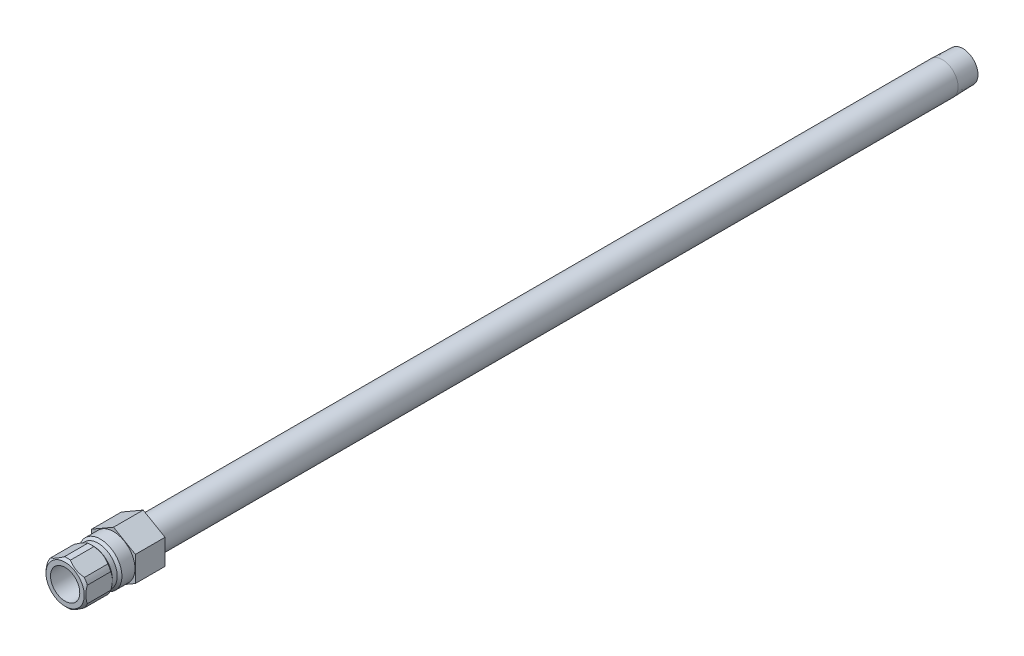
ISO-10303-21;
HEADER;
FILE_DESCRIPTION(('STEP AP214'),'2;1');
FILE_NAME('part.step','',(''),(''),'','','');
FILE_SCHEMA(('AUTOMOTIVE_DESIGN { 1 0 10303 214 1 1 1 1 }'));
ENDSEC;
DATA;
#1=APPLICATION_CONTEXT('core data for automotive mechanical design processes');
#2=APPLICATION_PROTOCOL_DEFINITION('international standard','automotive_design',2000,#1);
#3=PRODUCT_CONTEXT('',#1,'mechanical');
#4=PRODUCT('Part','Part','',(#3));
#5=PRODUCT_RELATED_PRODUCT_CATEGORY('part','',(#4));
#6=PRODUCT_DEFINITION_FORMATION('','',#4);
#7=PRODUCT_DEFINITION_CONTEXT('part definition',#1,'design');
#8=PRODUCT_DEFINITION('design','',#6,#7);
#9=PRODUCT_DEFINITION_SHAPE('','',#8);
#10=(LENGTH_UNIT() NAMED_UNIT(*) SI_UNIT(.MILLI.,.METRE.));
#11=(NAMED_UNIT(*) PLANE_ANGLE_UNIT() SI_UNIT($,.RADIAN.));
#12=(NAMED_UNIT(*) SI_UNIT($,.STERADIAN.) SOLID_ANGLE_UNIT());
#13=UNCERTAINTY_MEASURE_WITH_UNIT(LENGTH_MEASURE(1.E-05),#10,'distance_accuracy_value','');
#14=(GEOMETRIC_REPRESENTATION_CONTEXT(3) GLOBAL_UNCERTAINTY_ASSIGNED_CONTEXT((#13)) GLOBAL_UNIT_ASSIGNED_CONTEXT((#10,
#11,#12)) REPRESENTATION_CONTEXT('',''));
#15=CARTESIAN_POINT('',(0.,0.,0.));
#16=DIRECTION('',(0.,0.,1.));
#17=DIRECTION('',(1.,0.,0.));
#18=AXIS2_PLACEMENT_3D('',#15,#16,#17);
#19=CARTESIAN_POINT('',(0.,0.,-9.652));
#20=DIRECTION('',(0.,0.,-1.));
#21=DIRECTION('',(0.,1.,0.));
#22=AXIS2_PLACEMENT_3D('',#19,#20,#21);
#23=CYLINDRICAL_SURFACE('',#22,6.985);
#24=DIRECTION('',(0.,0.,-1.));
#25=VECTOR('',#24,1.);
#26=CARTESIAN_POINT('',(6.477,2.61509005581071,-9.652));
#27=LINE('',#26,#25);
#28=CARTESIAN_POINT('',(6.477,2.61509005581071,7.366));
#29=VERTEX_POINT('',#28);
#30=CARTESIAN_POINT('',(6.477,2.61509005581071,14.986));
#31=VERTEX_POINT('',#30);
#32=EDGE_CURVE('E372',#29,#31,#27,.F.);
#33=ORIENTED_EDGE('',*,*,#32,.F.);
#34=CARTESIAN_POINT('',(0.,0.,7.366));
#35=DIRECTION('',(0.,0.,-1.));
#36=DIRECTION('',(0.,1.,0.));
#37=AXIS2_PLACEMENT_3D('',#34,#35,#36);
#38=CIRCLE('',#37,6.985);
#39=CARTESIAN_POINT('',(5.50323442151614,4.30170151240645,7.366));
#40=VERTEX_POINT('',#39);
#41=EDGE_CURVE('E190',#40,#29,#38,.T.);
#42=ORIENTED_EDGE('',*,*,#41,.F.);
#43=DIRECTION('',(0.,0.,-1.));
#44=VECTOR('',#43,1.);
#45=CARTESIAN_POINT('',(5.50323442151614,4.30170151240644,-9.652));
#46=LINE('',#45,#44);
#47=CARTESIAN_POINT('',(5.50323442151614,4.30170151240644,14.986));
#48=VERTEX_POINT('',#47);
#49=EDGE_CURVE('E363',#48,#40,#46,.T.);
#50=ORIENTED_EDGE('',*,*,#49,.F.);
#51=CARTESIAN_POINT('',(0.,0.,14.986));
#52=DIRECTION('',(0.,0.,-1.));
#53=DIRECTION('',(0.,1.,0.));
#54=AXIS2_PLACEMENT_3D('',#51,#52,#53);
#55=CIRCLE('',#54,6.985);
#56=EDGE_CURVE('E205',#48,#31,#55,.T.);
#57=ORIENTED_EDGE('',*,*,#56,.T.);
#58=EDGE_LOOP('',(#33,#42,#50,#57));
#59=FACE_BOUND('',#58,.T.);
#60=ADVANCED_FACE('F34',(#59),#23,.T.);
#61=DIRECTION('',(0.,0.,-1.));
#62=VECTOR('',#61,1.);
#63=CARTESIAN_POINT('',(0.97376557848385,6.91679156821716,-9.652));
#64=LINE('',#63,#62);
#65=CARTESIAN_POINT('',(0.973765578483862,6.91679156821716,7.366));
#66=VERTEX_POINT('',#65);
#67=CARTESIAN_POINT('',(0.97376557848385,6.91679156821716,14.986));
#68=VERTEX_POINT('',#67);
#69=EDGE_CURVE('E283',#66,#68,#64,.F.);
#70=ORIENTED_EDGE('',*,*,#69,.F.);
#71=CARTESIAN_POINT('',(-0.973765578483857,6.91679156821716,7.366));
#72=VERTEX_POINT('',#71);
#73=EDGE_CURVE('E194',#72,#66,#38,.T.);
#74=ORIENTED_EDGE('',*,*,#73,.F.);
#75=DIRECTION('',(0.,0.,-1.));
#76=VECTOR('',#75,1.);
#77=CARTESIAN_POINT('',(-0.97376557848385,6.91679156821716,-9.652));
#78=LINE('',#77,#76);
#79=CARTESIAN_POINT('',(-0.97376557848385,6.91679156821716,14.986));
#80=VERTEX_POINT('',#79);
#81=EDGE_CURVE('E54',#80,#72,#78,.T.);
#82=ORIENTED_EDGE('',*,*,#81,.F.);
#83=EDGE_CURVE('E193',#80,#68,#55,.T.);
#84=ORIENTED_EDGE('',*,*,#83,.T.);
#85=EDGE_LOOP('',(#70,#74,#82,#84));
#86=FACE_BOUND('',#85,.T.);
#87=ADVANCED_FACE('F317',(#86),#23,.T.);
#88=DIRECTION('',(0.,0.,-1.));
#89=VECTOR('',#88,1.);
#90=CARTESIAN_POINT('',(-5.50323442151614,4.30170151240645,-9.652));
#91=LINE('',#90,#89);
#92=CARTESIAN_POINT('',(-5.50323442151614,4.30170151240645,7.366));
#93=VERTEX_POINT('',#92);
#94=CARTESIAN_POINT('',(-5.50323442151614,4.30170151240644,14.986));
#95=VERTEX_POINT('',#94);
#96=EDGE_CURVE('E361',#93,#95,#91,.F.);
#97=ORIENTED_EDGE('',*,*,#96,.F.);
#98=CARTESIAN_POINT('',(-6.477,2.6150900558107,7.366));
#99=VERTEX_POINT('',#98);
#100=EDGE_CURVE('E199',#99,#93,#38,.T.);
#101=ORIENTED_EDGE('',*,*,#100,.F.);
#102=DIRECTION('',(0.,0.,-1.));
#103=VECTOR('',#102,1.);
#104=CARTESIAN_POINT('',(-6.477,2.61509005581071,-9.652));
#105=LINE('',#104,#103);
#106=CARTESIAN_POINT('',(-6.477,2.6150900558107,14.986));
#107=VERTEX_POINT('',#106);
#108=EDGE_CURVE('E62',#107,#99,#105,.T.);
#109=ORIENTED_EDGE('',*,*,#108,.F.);
#110=EDGE_CURVE('E204',#107,#95,#55,.T.);
#111=ORIENTED_EDGE('',*,*,#110,.T.);
#112=EDGE_LOOP('',(#97,#101,#109,#111));
#113=FACE_BOUND('',#112,.T.);
#114=ADVANCED_FACE('F322',(#113),#23,.T.);
#115=DIRECTION('',(0.,0.,-1.));
#116=VECTOR('',#115,1.);
#117=CARTESIAN_POINT('',(-6.477,-2.61509005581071,-9.652));
#118=LINE('',#117,#116);
#119=CARTESIAN_POINT('',(-6.477,-2.61509005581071,7.366));
#120=VERTEX_POINT('',#119);
#121=CARTESIAN_POINT('',(-6.477,-2.61509005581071,14.986));
#122=VERTEX_POINT('',#121);
#123=EDGE_CURVE('E353',#120,#122,#118,.F.);
#124=ORIENTED_EDGE('',*,*,#123,.F.);
#125=CARTESIAN_POINT('',(-5.50323442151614,-4.30170151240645,7.366));
#126=VERTEX_POINT('',#125);
#127=EDGE_CURVE('E195',#126,#120,#38,.T.);
#128=ORIENTED_EDGE('',*,*,#127,.F.);
#129=DIRECTION('',(0.,0.,-1.));
#130=VECTOR('',#129,1.);
#131=CARTESIAN_POINT('',(-5.50323442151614,-4.30170151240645,-9.652));
#132=LINE('',#131,#130);
#133=CARTESIAN_POINT('',(-5.50323442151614,-4.30170151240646,14.986));
#134=VERTEX_POINT('',#133);
#135=EDGE_CURVE('E239',#134,#126,#132,.T.);
#136=ORIENTED_EDGE('',*,*,#135,.F.);
#137=EDGE_CURVE('E367',#134,#122,#55,.T.);
#138=ORIENTED_EDGE('',*,*,#137,.T.);
#139=EDGE_LOOP('',(#124,#128,#136,#138));
#140=FACE_BOUND('',#139,.T.);
#141=ADVANCED_FACE('F332',(#140),#23,.T.);
#142=DIRECTION('',(0.,0.,-1.));
#143=VECTOR('',#142,1.);
#144=CARTESIAN_POINT('',(-0.973765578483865,-6.91679156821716,-9.652));
#145=LINE('',#144,#143);
#146=CARTESIAN_POINT('',(-0.973765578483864,-6.91679156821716,7.366));
#147=VERTEX_POINT('',#146);
#148=CARTESIAN_POINT('',(-0.973765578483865,-6.91679156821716,14.986));
#149=VERTEX_POINT('',#148);
#150=EDGE_CURVE('E342',#147,#149,#145,.F.);
#151=ORIENTED_EDGE('',*,*,#150,.F.);
#152=CARTESIAN_POINT('',(0.973765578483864,-6.91679156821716,7.366));
#153=VERTEX_POINT('',#152);
#154=EDGE_CURVE('E191',#153,#147,#38,.T.);
#155=ORIENTED_EDGE('',*,*,#154,.F.);
#156=DIRECTION('',(0.,0.,-1.));
#157=VECTOR('',#156,1.);
#158=CARTESIAN_POINT('',(0.973765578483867,-6.91679156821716,-9.652));
#159=LINE('',#158,#157);
#160=CARTESIAN_POINT('',(0.973765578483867,-6.91679156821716,14.986));
#161=VERTEX_POINT('',#160);
#162=EDGE_CURVE('E168',#161,#153,#159,.T.);
#163=ORIENTED_EDGE('',*,*,#162,.F.);
#164=EDGE_CURVE('E344',#161,#149,#55,.T.);
#165=ORIENTED_EDGE('',*,*,#164,.T.);
#166=EDGE_LOOP('',(#151,#155,#163,#165));
#167=FACE_BOUND('',#166,.T.);
#168=ADVANCED_FACE('F326',(#167),#23,.T.);
#169=CARTESIAN_POINT('',(0.,0.,-9.652));
#170=DIRECTION('',(0.,0.,-1.));
#171=DIRECTION('',(0.,1.,0.));
#172=AXIS2_PLACEMENT_3D('',#169,#170,#171);
#173=CYLINDRICAL_SURFACE('',#172,4.7625);
#174=CARTESIAN_POINT('',(0.,0.,3.556));
#175=DIRECTION('',(0.,0.,-1.));
#176=DIRECTION('',(0.,1.,0.));
#177=AXIS2_PLACEMENT_3D('',#174,#175,#176);
#178=CIRCLE('',#177,4.7625);
#179=CARTESIAN_POINT('',(0.,4.7625,3.556));
#180=VERTEX_POINT('',#179);
#181=EDGE_CURVE('E420',#180,#180,#178,.T.);
#182=ORIENTED_EDGE('',*,*,#181,.T.);
#183=EDGE_LOOP('',(#182));
#184=FACE_BOUND('',#183,.T.);
#185=CARTESIAN_POINT('',(0.,0.,15.748));
#186=DIRECTION('',(0.,0.,-1.));
#187=DIRECTION('',(0.,1.,0.));
#188=AXIS2_PLACEMENT_3D('',#185,#186,#187);
#189=CIRCLE('',#188,4.7625);
#190=CARTESIAN_POINT('',(0.,4.7625,15.748));
#191=VERTEX_POINT('',#190);
#192=EDGE_CURVE('E209',#191,#191,#189,.T.);
#193=ORIENTED_EDGE('',*,*,#192,.F.);
#194=EDGE_LOOP('',(#193));
#195=FACE_BOUND('',#194,.T.);
#196=ADVANCED_FACE('F36',(#184,#195),#173,.F.);
#197=CARTESIAN_POINT('',(0.,4.7625,15.748));
#198=DIRECTION('',(0.,0.,1.));
#199=DIRECTION('',(0.,-1.,0.));
#200=AXIS2_PLACEMENT_3D('',#197,#198,#199);
#201=PLANE('',#200);
#202=ORIENTED_EDGE('',*,*,#192,.T.);
#203=EDGE_LOOP('',(#202));
#204=FACE_BOUND('',#203,.T.);
#205=CARTESIAN_POINT('',(0.,0.,15.748));
#206=DIRECTION('',(0.,0.,-1.));
#207=DIRECTION('',(0.,1.,0.));
#208=AXIS2_PLACEMENT_3D('',#205,#206,#207);
#209=CIRCLE('',#208,6.223);
#210=CARTESIAN_POINT('',(0.,6.223,15.748));
#211=VERTEX_POINT('',#210);
#212=EDGE_CURVE('E206',#211,#211,#209,.T.);
#213=ORIENTED_EDGE('',*,*,#212,.F.);
#214=EDGE_LOOP('',(#213));
#215=FACE_BOUND('',#214,.T.);
#216=ADVANCED_FACE('F245',(#204,#215),#201,.T.);
#217=CARTESIAN_POINT('',(0.,0.,14.986));
#218=DIRECTION('',(0.,0.,-1.));
#219=DIRECTION('',(0.,1.,0.));
#220=AXIS2_PLACEMENT_3D('',#217,#218,#219);
#221=CONICAL_SURFACE('',#220,6.985,0.785398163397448);
#222=CARTESIAN_POINT('',(6.477,-7.50531717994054,12.0573066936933));
#223=CARTESIAN_POINT('',(6.477,-7.32278230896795,12.1954662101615));
#224=CARTESIAN_POINT('',(6.477,-7.13923073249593,12.3323042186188));
#225=CARTESIAN_POINT('',(6.477,-6.76969107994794,12.6027438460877));
#226=CARTESIAN_POINT('',(6.477,-6.58370240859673,12.7363446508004));
#227=CARTESIAN_POINT('',(6.477,-6.20752484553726,13.0006667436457));
#228=CARTESIAN_POINT('',(6.477,-6.01731457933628,13.1313577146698));
#229=CARTESIAN_POINT('',(6.477,-5.63367369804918,13.3879087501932));
#230=CARTESIAN_POINT('',(6.477,-5.44024331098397,13.5137691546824));
#231=CARTESIAN_POINT('',(6.477,-5.03831720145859,13.7667102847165));
#232=CARTESIAN_POINT('',(6.477,-4.82959841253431,13.8934383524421));
#233=CARTESIAN_POINT('',(6.477,-4.4072839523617,14.1386241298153));
#234=CARTESIAN_POINT('',(6.477,-4.19368750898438,14.2570805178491));
#235=CARTESIAN_POINT('',(6.477,-3.76162676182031,14.4831715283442));
#236=CARTESIAN_POINT('',(6.477,-3.54317924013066,14.5908379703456));
#237=CARTESIAN_POINT('',(6.477,-3.10029556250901,14.7929384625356));
#238=CARTESIAN_POINT('',(6.477,-2.87586219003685,14.8873785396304));
#239=CARTESIAN_POINT('',(6.477,-2.43955826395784,15.0524966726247));
#240=CARTESIAN_POINT('',(6.477,-2.22819339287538,15.1244971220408));
#241=CARTESIAN_POINT('',(6.477,-1.80033354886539,15.2515475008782));
#242=CARTESIAN_POINT('',(6.477,-1.58383822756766,15.3065962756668));
#243=CARTESIAN_POINT('',(6.477,-1.1506339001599,15.3959385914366));
#244=CARTESIAN_POINT('',(6.477,-0.934000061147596,15.4305906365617));
#245=CARTESIAN_POINT('',(6.477,-0.498364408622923,15.4784594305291));
#246=CARTESIAN_POINT('',(6.477,-0.2793630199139,15.4916799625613));
#247=CARTESIAN_POINT('',(6.477,0.150697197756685,15.4956835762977));
#248=CARTESIAN_POINT('',(6.477,0.361748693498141,15.4872823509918));
#249=CARTESIAN_POINT('',(6.477,0.782066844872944,15.4503172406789));
#250=CARTESIAN_POINT('',(6.477,0.991333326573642,15.421751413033));
#251=CARTESIAN_POINT('',(6.477,1.41010575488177,15.3455375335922));
#252=CARTESIAN_POINT('',(6.477,1.6195513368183,15.2975631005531));
#253=CARTESIAN_POINT('',(6.477,2.03387291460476,15.1851046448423));
#254=CARTESIAN_POINT('',(6.477,2.23874927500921,15.1206219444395));
#255=CARTESIAN_POINT('',(6.477,2.66141718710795,14.9715598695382));
#256=CARTESIAN_POINT('',(6.477,2.87875617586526,14.8857103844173));
#257=CARTESIAN_POINT('',(6.477,3.30779766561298,14.7008180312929));
#258=CARTESIAN_POINT('',(6.477,3.51949749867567,14.6017690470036));
#259=CARTESIAN_POINT('',(6.477,3.93828980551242,14.3928329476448));
#260=CARTESIAN_POINT('',(6.477,4.14536521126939,14.282911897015));
#261=CARTESIAN_POINT('',(6.477,4.55475391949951,14.0546596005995));
#262=CARTESIAN_POINT('',(6.477,4.75706796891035,13.93632968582));
#263=CARTESIAN_POINT('',(6.477,5.14761370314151,13.6989609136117));
#264=CARTESIAN_POINT('',(6.477,5.33604552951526,13.580249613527));
#265=CARTESIAN_POINT('',(6.477,5.70967381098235,13.3378251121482));
#266=CARTESIAN_POINT('',(6.477,5.89487001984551,13.2141115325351));
#267=CARTESIAN_POINT('',(6.477,6.26095063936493,12.9635958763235));
#268=CARTESIAN_POINT('',(6.477,6.4418578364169,12.8368269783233));
#269=CARTESIAN_POINT('',(6.477,6.80119835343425,12.5799293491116));
#270=CARTESIAN_POINT('',(6.477,6.97963234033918,12.4498015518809));
#271=CARTESIAN_POINT('',(6.477,7.15703038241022,12.3183002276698));
#272=B_SPLINE_CURVE_WITH_KNOTS('',3,(#222,#223,#224,#225,#226,#227,#228,#229,#230,#231,#232,
#233,#234,#235,#236,#237,#238,#239,#240,#241,#242,#243,#244,#245,#246,#247,#248,#249,#250,#251,
#252,#253,#254,#255,#256,#257,#258,#259,#260,#261,#262,#263,#264,#265,#266,#267,#268,#269,#270,
#271),.UNSPECIFIED.,.F.,.F.,(4,2,2,2,2,2,2,2,2,2,2,2,2,2,2,2,2,2,2,2,2,2,2,2,4),(0.,
0.68679090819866,1.37375281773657,2.06603541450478,2.75826919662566,3.49065471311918,
4.22315698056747,4.95343127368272,5.68337170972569,6.35265989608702,7.02199365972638,
7.67918147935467,8.33625327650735,8.96890298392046,9.60161364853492,10.2454384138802,
10.8892116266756,11.5897073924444,12.2905288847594,12.9936114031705,13.696582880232,
14.3646145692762,15.0326968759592,15.6953618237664,16.3578444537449),.UNSPECIFIED.);
#273=CARTESIAN_POINT('',(6.477,-2.61509005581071,14.986));
#274=VERTEX_POINT('',#273);
#275=EDGE_CURVE('E375',#31,#274,#272,.F.);
#276=ORIENTED_EDGE('',*,*,#275,.F.);
#277=ORIENTED_EDGE('',*,*,#56,.F.);
#278=CARTESIAN_POINT('',(0.973302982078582,6.91705864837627,14.9858));
#279=CARTESIAN_POINT('',(1.1543052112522,6.81255696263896,15.0641166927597));
#280=CARTESIAN_POINT('',(1.3378209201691,6.70660411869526,15.1353544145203));
#281=CARTESIAN_POINT('',(1.70963160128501,6.49193912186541,15.2608524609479));
#282=CARTESIAN_POINT('',(1.89793754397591,6.38322063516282,15.3150691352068));
#283=CARTESIAN_POINT('',(2.27146153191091,6.16756646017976,15.401724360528));
#284=CARTESIAN_POINT('',(2.45655498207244,6.06070270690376,15.4348622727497));
#285=CARTESIAN_POINT('',(2.82844640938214,5.8459910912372,15.4802195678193));
#286=CARTESIAN_POINT('',(3.0152419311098,5.73814464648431,15.4924653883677));
#287=CARTESIAN_POINT('',(3.3948057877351,5.51900335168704,15.4953056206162));
#288=CARTESIAN_POINT('',(3.58757842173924,5.40770601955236,15.4852117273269));
#289=CARTESIAN_POINT('',(3.97148128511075,5.18605959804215,15.4426708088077));
#290=CARTESIAN_POINT('',(4.16260891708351,5.0757120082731,15.4101933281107));
#291=CARTESIAN_POINT('',(4.54854122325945,4.85289388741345,15.3234273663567));
#292=CARTESIAN_POINT('',(4.74321398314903,4.74049951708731,15.268364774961));
#293=CARTESIAN_POINT('',(5.03141021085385,4.5741093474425,15.1720079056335));
#294=CARTESIAN_POINT('',(5.12673323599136,4.51907457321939,15.1376422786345));
#295=CARTESIAN_POINT('',(5.31613879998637,4.40972121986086,15.0647445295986));
#296=CARTESIAN_POINT('',(5.41022179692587,4.35540237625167,15.0262139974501));
#297=CARTESIAN_POINT('',(5.50369701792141,4.30143443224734,14.9858));
#298=B_SPLINE_CURVE_WITH_KNOTS('',3,(#278,#279,#280,#281,#282,#283,#284,#285,#286,#287,#288,
#289,#290,#291,#292,#293,#294,#295,#296,#297),.UNSPECIFIED.,.F.,.F.,(4,2,2,2,2,2,2,2,2,4),(0.,
0.669810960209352,1.34132587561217,1.98920541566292,2.63626449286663,3.30353665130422,
3.97171850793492,4.66502165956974,5.01088265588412,5.35661208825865),.UNSPECIFIED.);
#299=EDGE_CURVE('E275',#68,#48,#298,.T.);
#300=ORIENTED_EDGE('',*,*,#299,.F.);
#301=ORIENTED_EDGE('',*,*,#83,.F.);
#302=CARTESIAN_POINT('',(-5.50369701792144,4.30143443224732,14.9858));
#303=CARTESIAN_POINT('',(-5.32269478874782,4.40593611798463,15.0641166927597));
#304=CARTESIAN_POINT('',(-5.13917907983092,4.51188896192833,15.1353544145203));
#305=CARTESIAN_POINT('',(-4.76736839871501,4.72655395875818,15.2608524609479));
#306=CARTESIAN_POINT('',(-4.57906245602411,4.83527244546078,15.3150691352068));
#307=CARTESIAN_POINT('',(-4.2055384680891,5.05092662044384,15.401724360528));
#308=CARTESIAN_POINT('',(-4.02044501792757,5.15779037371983,15.4348622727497));
#309=CARTESIAN_POINT('',(-3.64855359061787,5.3725019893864,15.4802195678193));
#310=CARTESIAN_POINT('',(-3.46175806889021,5.48034843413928,15.4924653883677));
#311=CARTESIAN_POINT('',(-3.0821942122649,5.69948972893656,15.4953056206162));
#312=CARTESIAN_POINT('',(-2.88942157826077,5.81078706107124,15.4852117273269));
#313=CARTESIAN_POINT('',(-2.50551871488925,6.03243348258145,15.4426708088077));
#314=CARTESIAN_POINT('',(-2.31439108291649,6.1427810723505,15.4101933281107));
#315=CARTESIAN_POINT('',(-1.92845877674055,6.36559919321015,15.3234273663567));
#316=CARTESIAN_POINT('',(-1.73378601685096,6.47799356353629,15.268364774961));
#317=CARTESIAN_POINT('',(-1.44558978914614,6.64438373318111,15.1720079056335));
#318=CARTESIAN_POINT('',(-1.35026676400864,6.69941850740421,15.1376422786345));
#319=CARTESIAN_POINT('',(-1.16086120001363,6.80877186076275,15.0647445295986));
#320=CARTESIAN_POINT('',(-1.06677820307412,6.86309070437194,15.0262139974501));
#321=CARTESIAN_POINT('',(-0.973302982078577,6.91705864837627,14.9858));
#322=B_SPLINE_CURVE_WITH_KNOTS('',3,(#302,#303,#304,#305,#306,#307,#308,#309,#310,#311,#312,
#313,#314,#315,#316,#317,#318,#319,#320,#321),.UNSPECIFIED.,.F.,.F.,(4,2,2,2,2,2,2,2,2,4),(0.,
0.669810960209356,1.34132587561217,1.98920541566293,2.63626449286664,3.30353665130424,
3.97171850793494,4.66502165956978,5.01088265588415,5.35661208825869),.UNSPECIFIED.);
#323=EDGE_CURVE('E267',#95,#80,#322,.T.);
#324=ORIENTED_EDGE('',*,*,#323,.F.);
#325=ORIENTED_EDGE('',*,*,#110,.F.);
#326=CARTESIAN_POINT('',(-6.477,-7.50531717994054,12.0573066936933));
#327=CARTESIAN_POINT('',(-6.477,-7.32278230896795,12.1954662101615));
#328=CARTESIAN_POINT('',(-6.477,-7.13923073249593,12.3323042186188));
#329=CARTESIAN_POINT('',(-6.477,-6.76969107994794,12.6027438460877));
#330=CARTESIAN_POINT('',(-6.477,-6.58370240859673,12.7363446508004));
#331=CARTESIAN_POINT('',(-6.477,-6.20752484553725,13.0006667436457));
#332=CARTESIAN_POINT('',(-6.477,-6.01731457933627,13.1313577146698));
#333=CARTESIAN_POINT('',(-6.477,-5.63367369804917,13.3879087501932));
#334=CARTESIAN_POINT('',(-6.477,-5.44024331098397,13.5137691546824));
#335=CARTESIAN_POINT('',(-6.477,-5.03831720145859,13.7667102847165));
#336=CARTESIAN_POINT('',(-6.477,-4.8295984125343,13.8934383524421));
#337=CARTESIAN_POINT('',(-6.477,-4.4072839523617,14.1386241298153));
#338=CARTESIAN_POINT('',(-6.477,-4.19368750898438,14.2570805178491));
#339=CARTESIAN_POINT('',(-6.477,-3.7616267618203,14.4831715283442));
#340=CARTESIAN_POINT('',(-6.477,-3.54317924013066,14.5908379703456));
#341=CARTESIAN_POINT('',(-6.477,-3.100295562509,14.7929384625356));
#342=CARTESIAN_POINT('',(-6.477,-2.87586219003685,14.8873785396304));
#343=CARTESIAN_POINT('',(-6.477,-2.43955826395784,15.0524966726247));
#344=CARTESIAN_POINT('',(-6.477,-2.22819339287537,15.1244971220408));
#345=CARTESIAN_POINT('',(-6.477,-1.80033354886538,15.2515475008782));
#346=CARTESIAN_POINT('',(-6.477,-1.58383822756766,15.3065962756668));
#347=CARTESIAN_POINT('',(-6.477,-1.15063390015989,15.3959385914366));
#348=CARTESIAN_POINT('',(-6.477,-0.934000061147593,15.4305906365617));
#349=CARTESIAN_POINT('',(-6.477,-0.498364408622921,15.4784594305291));
#350=CARTESIAN_POINT('',(-6.477,-0.279363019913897,15.4916799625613));
#351=CARTESIAN_POINT('',(-6.477,0.150697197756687,15.4956835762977));
#352=CARTESIAN_POINT('',(-6.477,0.361748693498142,15.4872823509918));
#353=CARTESIAN_POINT('',(-6.477,0.782066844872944,15.4503172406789));
#354=CARTESIAN_POINT('',(-6.477,0.991333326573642,15.421751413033));
#355=CARTESIAN_POINT('',(-6.477,1.41010575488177,15.3455375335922));
#356=CARTESIAN_POINT('',(-6.477,1.6195513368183,15.2975631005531));
#357=CARTESIAN_POINT('',(-6.477,2.03387291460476,15.1851046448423));
#358=CARTESIAN_POINT('',(-6.477,2.23874927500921,15.1206219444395));
#359=CARTESIAN_POINT('',(-6.477,2.66141718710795,14.9715598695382));
#360=CARTESIAN_POINT('',(-6.477,2.87875617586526,14.8857103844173));
#361=CARTESIAN_POINT('',(-6.477,3.30779766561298,14.7008180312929));
#362=CARTESIAN_POINT('',(-6.477,3.51949749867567,14.6017690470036));
#363=CARTESIAN_POINT('',(-6.477,3.93828980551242,14.3928329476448));
#364=CARTESIAN_POINT('',(-6.477,4.14536521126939,14.282911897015));
#365=CARTESIAN_POINT('',(-6.477,4.55475391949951,14.0546596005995));
#366=CARTESIAN_POINT('',(-6.477,4.75706796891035,13.93632968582));
#367=CARTESIAN_POINT('',(-6.477,5.14761370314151,13.6989609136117));
#368=CARTESIAN_POINT('',(-6.477,5.33604552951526,13.580249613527));
#369=CARTESIAN_POINT('',(-6.477,5.70967381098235,13.3378251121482));
#370=CARTESIAN_POINT('',(-6.477,5.89487001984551,13.2141115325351));
#371=CARTESIAN_POINT('',(-6.477,6.26095063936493,12.9635958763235));
#372=CARTESIAN_POINT('',(-6.477,6.4418578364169,12.8368269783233));
#373=CARTESIAN_POINT('',(-6.477,6.80119835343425,12.5799293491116));
#374=CARTESIAN_POINT('',(-6.477,6.97963234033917,12.4498015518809));
#375=CARTESIAN_POINT('',(-6.477,7.15703038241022,12.3183002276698));
#376=B_SPLINE_CURVE_WITH_KNOTS('',3,(#326,#327,#328,#329,#330,#331,#332,#333,#334,#335,#336,
#337,#338,#339,#340,#341,#342,#343,#344,#345,#346,#347,#348,#349,#350,#351,#352,#353,#354,#355,
#356,#357,#358,#359,#360,#361,#362,#363,#364,#365,#366,#367,#368,#369,#370,#371,#372,#373,#374,
#375),.UNSPECIFIED.,.F.,.F.,(4,2,2,2,2,2,2,2,2,2,2,2,2,2,2,2,2,2,2,2,2,2,2,2,4),(0.,
0.686790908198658,1.37375281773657,2.06603541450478,2.75826919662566,3.49065471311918,
4.22315698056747,4.95343127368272,5.68337170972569,6.35265989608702,7.02199365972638,
7.67918147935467,8.33625327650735,8.96890298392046,9.60161364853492,10.2454384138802,
10.8892116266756,11.5897073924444,12.2905288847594,12.9936114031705,13.696582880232,
14.3646145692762,15.0326968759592,15.6953618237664,16.3578444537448),.UNSPECIFIED.);
#377=EDGE_CURVE('E260',#122,#107,#376,.T.);
#378=ORIENTED_EDGE('',*,*,#377,.F.);
#379=ORIENTED_EDGE('',*,*,#137,.F.);
#380=CARTESIAN_POINT('',(-0.973302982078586,-6.91705864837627,14.9858));
#381=CARTESIAN_POINT('',(-1.1543052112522,-6.81255696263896,15.0641166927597));
#382=CARTESIAN_POINT('',(-1.3378209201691,-6.70660411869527,15.1353544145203));
#383=CARTESIAN_POINT('',(-1.70963160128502,-6.49193912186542,15.2608524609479));
#384=CARTESIAN_POINT('',(-1.89793754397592,-6.38322063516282,15.3150691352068));
#385=CARTESIAN_POINT('',(-2.27146153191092,-6.16756646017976,15.401724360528));
#386=CARTESIAN_POINT('',(-2.45655498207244,-6.06070270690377,15.4348622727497));
#387=CARTESIAN_POINT('',(-2.82844640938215,-5.8459910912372,15.4802195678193));
#388=CARTESIAN_POINT('',(-3.0152419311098,-5.73814464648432,15.4924653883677));
#389=CARTESIAN_POINT('',(-3.39480578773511,-5.51900335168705,15.4953056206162));
#390=CARTESIAN_POINT('',(-3.58757842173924,-5.40770601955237,15.4852117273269));
#391=CARTESIAN_POINT('',(-3.97148128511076,-5.18605959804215,15.4426708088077));
#392=CARTESIAN_POINT('',(-4.16260891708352,-5.0757120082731,15.4101933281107));
#393=CARTESIAN_POINT('',(-4.54854122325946,-4.85289388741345,15.3234273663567));
#394=CARTESIAN_POINT('',(-4.74321398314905,-4.74049951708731,15.268364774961));
#395=CARTESIAN_POINT('',(-5.03141021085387,-4.57410934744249,15.1720079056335));
#396=CARTESIAN_POINT('',(-5.12673323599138,-4.51907457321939,15.1376422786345));
#397=CARTESIAN_POINT('',(-5.31613879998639,-4.40972121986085,15.0647445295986));
#398=CARTESIAN_POINT('',(-5.4102217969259,-4.35540237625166,15.0262139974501));
#399=CARTESIAN_POINT('',(-5.50369701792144,-4.30143443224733,14.9858));
#400=B_SPLINE_CURVE_WITH_KNOTS('',3,(#380,#381,#382,#383,#384,#385,#386,#387,#388,#389,#390,
#391,#392,#393,#394,#395,#396,#397,#398,#399),.UNSPECIFIED.,.F.,.F.,(4,2,2,2,2,2,2,2,2,4),(0.,
0.669810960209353,1.34132587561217,1.98920541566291,2.63626449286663,3.30353665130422,
3.97171850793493,4.66502165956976,5.01088265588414,5.35661208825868),.UNSPECIFIED.);
#401=EDGE_CURVE('E253',#149,#134,#400,.T.);
#402=ORIENTED_EDGE('',*,*,#401,.F.);
#403=ORIENTED_EDGE('',*,*,#164,.F.);
#404=CARTESIAN_POINT('',(5.50369701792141,-4.30143443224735,14.9858));
#405=CARTESIAN_POINT('',(5.32269478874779,-4.40593611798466,15.0641166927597));
#406=CARTESIAN_POINT('',(5.13917907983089,-4.51188896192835,15.1353544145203));
#407=CARTESIAN_POINT('',(4.76736839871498,-4.7265539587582,15.2608524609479));
#408=CARTESIAN_POINT('',(4.57906245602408,-4.8352724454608,15.3150691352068));
#409=CARTESIAN_POINT('',(4.20553846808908,-5.05092662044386,15.401724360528));
#410=CARTESIAN_POINT('',(4.02044501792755,-5.15779037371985,15.4348622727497));
#411=CARTESIAN_POINT('',(3.64855359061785,-5.37250198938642,15.4802195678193));
#412=CARTESIAN_POINT('',(3.46175806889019,-5.4803484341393,15.4924653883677));
#413=CARTESIAN_POINT('',(3.08219421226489,-5.69948972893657,15.4953056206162));
#414=CARTESIAN_POINT('',(2.88942157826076,-5.81078706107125,15.4852117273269));
#415=CARTESIAN_POINT('',(2.50551871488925,-6.03243348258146,15.4426708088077));
#416=CARTESIAN_POINT('',(2.31439108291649,-6.14278107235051,15.4101933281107));
#417=CARTESIAN_POINT('',(1.92845877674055,-6.36559919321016,15.3234273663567));
#418=CARTESIAN_POINT('',(1.73378601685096,-6.4779935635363,15.268364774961));
#419=CARTESIAN_POINT('',(1.44558978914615,-6.64438373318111,15.1720079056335));
#420=CARTESIAN_POINT('',(1.35026676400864,-6.69941850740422,15.1376422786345));
#421=CARTESIAN_POINT('',(1.16086120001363,-6.80877186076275,15.0647445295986));
#422=CARTESIAN_POINT('',(1.06677820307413,-6.86309070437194,15.0262139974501));
#423=CARTESIAN_POINT('',(0.973302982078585,-6.91705864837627,14.9858));
#424=B_SPLINE_CURVE_WITH_KNOTS('',3,(#404,#405,#406,#407,#408,#409,#410,#411,#412,#413,#414,
#415,#416,#417,#418,#419,#420,#421,#422,#423),.UNSPECIFIED.,.F.,.F.,(4,2,2,2,2,2,2,2,2,4),(0.,
0.669810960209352,1.34132587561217,1.98920541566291,2.63626449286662,3.30353665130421,
3.9717185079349,4.66502165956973,5.0108826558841,5.35661208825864),.UNSPECIFIED.);
#425=CARTESIAN_POINT('',(5.50323442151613,-4.30170151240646,14.986));
#426=VERTEX_POINT('',#425);
#427=EDGE_CURVE('E184',#426,#161,#424,.T.);
#428=ORIENTED_EDGE('',*,*,#427,.F.);
#429=EDGE_CURVE('E183',#274,#426,#55,.T.);
#430=ORIENTED_EDGE('',*,*,#429,.F.);
#431=EDGE_LOOP('',(#276,#277,#300,#301,#324,#325,#378,#379,#402,#403,#428,#430));
#432=FACE_BOUND('',#431,.T.);
#433=ORIENTED_EDGE('',*,*,#212,.T.);
#434=EDGE_LOOP('',(#433));
#435=FACE_BOUND('',#434,.T.);
#436=ADVANCED_FACE('F242',(#432,#435),#221,.T.);
#437=DIRECTION('',(0.,0.,-1.));
#438=VECTOR('',#437,1.);
#439=CARTESIAN_POINT('',(6.477,-2.61509005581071,-9.652));
#440=LINE('',#439,#438);
#441=CARTESIAN_POINT('',(6.477,-2.61509005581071,7.366));
#442=VERTEX_POINT('',#441);
#443=EDGE_CURVE('E282',#274,#442,#440,.T.);
#444=ORIENTED_EDGE('',*,*,#443,.F.);
#445=ORIENTED_EDGE('',*,*,#429,.T.);
#446=DIRECTION('',(0.,0.,-1.));
#447=VECTOR('',#446,1.);
#448=CARTESIAN_POINT('',(5.50323442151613,-4.30170151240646,-9.652));
#449=LINE('',#448,#447);
#450=CARTESIAN_POINT('',(5.50323442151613,-4.30170151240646,7.366));
#451=VERTEX_POINT('',#450);
#452=EDGE_CURVE('E165',#451,#426,#449,.F.);
#453=ORIENTED_EDGE('',*,*,#452,.F.);
#454=EDGE_CURVE('E181',#442,#451,#38,.T.);
#455=ORIENTED_EDGE('',*,*,#454,.F.);
#456=EDGE_LOOP('',(#444,#445,#453,#455));
#457=FACE_BOUND('',#456,.T.);
#458=ADVANCED_FACE('F180',(#457),#23,.T.);
#459=CARTESIAN_POINT('',(0.,0.,6.604));
#460=DIRECTION('',(0.,0.,1.));
#461=DIRECTION('',(0.,-1.,0.));
#462=AXIS2_PLACEMENT_3D('',#459,#460,#461);
#463=CONICAL_SURFACE('',#462,6.223,0.785398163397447);
#464=CARTESIAN_POINT('',(6.477,-7.50531717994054,10.2946933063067));
#465=CARTESIAN_POINT('',(6.477,-7.32278230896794,10.1565337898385));
#466=CARTESIAN_POINT('',(6.477,-7.13923073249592,10.0196957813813));
#467=CARTESIAN_POINT('',(6.477,-6.76969107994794,9.74925615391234));
#468=CARTESIAN_POINT('',(6.477,-6.58370240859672,9.61565534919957));
#469=CARTESIAN_POINT('',(6.477,-6.20752484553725,9.35133325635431));
#470=CARTESIAN_POINT('',(6.477,-6.01731457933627,9.22064228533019));
#471=CARTESIAN_POINT('',(6.477,-5.63367369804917,8.96409124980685));
#472=CARTESIAN_POINT('',(6.477,-5.44024331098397,8.83823084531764));
#473=CARTESIAN_POINT('',(6.477,-5.03831720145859,8.58528971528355));
#474=CARTESIAN_POINT('',(6.477,-4.82959841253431,8.45856164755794));
#475=CARTESIAN_POINT('',(6.477,-4.4072839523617,8.21337587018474));
#476=CARTESIAN_POINT('',(6.477,-4.19368750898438,8.09491948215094));
#477=CARTESIAN_POINT('',(6.477,-3.76162676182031,7.8688284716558));
#478=CARTESIAN_POINT('',(6.477,-3.54317924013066,7.76116202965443));
#479=CARTESIAN_POINT('',(6.477,-3.10029556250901,7.55906153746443));
#480=CARTESIAN_POINT('',(6.477,-2.87586219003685,7.46462146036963));
#481=CARTESIAN_POINT('',(6.477,-2.43955826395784,7.2995033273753));
#482=CARTESIAN_POINT('',(6.477,-2.22819339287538,7.2275028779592));
#483=CARTESIAN_POINT('',(6.477,-1.80033354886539,7.10045249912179));
#484=CARTESIAN_POINT('',(6.477,-1.58383822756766,7.0454037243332));
#485=CARTESIAN_POINT('',(6.477,-1.1506339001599,6.95606140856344));
#486=CARTESIAN_POINT('',(6.477,-0.934000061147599,6.92140936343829));
#487=CARTESIAN_POINT('',(6.477,-0.498364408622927,6.87354056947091));
#488=CARTESIAN_POINT('',(6.477,-0.279363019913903,6.86032003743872));
#489=CARTESIAN_POINT('',(6.477,0.15069719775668,6.85631642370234));
#490=CARTESIAN_POINT('',(6.477,0.361748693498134,6.8647176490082));
#491=CARTESIAN_POINT('',(6.477,0.782066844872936,6.90168275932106));
#492=CARTESIAN_POINT('',(6.477,0.991333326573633,6.93024858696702));
#493=CARTESIAN_POINT('',(6.477,1.41010575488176,7.00646246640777));
#494=CARTESIAN_POINT('',(6.477,1.61955133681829,7.05443689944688));
#495=CARTESIAN_POINT('',(6.477,2.03387291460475,7.16689535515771));
#496=CARTESIAN_POINT('',(6.477,2.2387492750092,7.23137805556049));
#497=CARTESIAN_POINT('',(6.477,2.66141718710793,7.38044013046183));
#498=CARTESIAN_POINT('',(6.477,2.87875617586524,7.46628961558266));
#499=CARTESIAN_POINT('',(6.477,3.30779766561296,7.65118196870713));
#500=CARTESIAN_POINT('',(6.477,3.51949749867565,7.75023095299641));
#501=CARTESIAN_POINT('',(6.477,3.93828980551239,7.95916705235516));
#502=CARTESIAN_POINT('',(6.477,4.14536521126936,8.069088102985));
#503=CARTESIAN_POINT('',(6.477,4.55475391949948,8.29734039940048));
#504=CARTESIAN_POINT('',(6.477,4.75706796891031,8.41567031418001));
#505=CARTESIAN_POINT('',(6.477,5.14761370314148,8.65303908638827));
#506=CARTESIAN_POINT('',(6.477,5.33604552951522,8.77175038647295));
#507=CARTESIAN_POINT('',(6.477,5.70967381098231,9.01417488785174));
#508=CARTESIAN_POINT('',(6.477,5.89487001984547,9.13788846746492));
#509=CARTESIAN_POINT('',(6.477,6.26095063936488,9.38840412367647));
#510=CARTESIAN_POINT('',(6.477,6.44185783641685,9.5151730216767));
#511=CARTESIAN_POINT('',(6.477,6.8011983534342,9.77207065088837));
#512=CARTESIAN_POINT('',(6.477,6.97963234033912,9.90219844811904));
#513=CARTESIAN_POINT('',(6.477,7.15703038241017,10.0336997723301));
#514=B_SPLINE_CURVE_WITH_KNOTS('',3,(#464,#465,#466,#467,#468,#469,#470,#471,#472,#473,#474,
#475,#476,#477,#478,#479,#480,#481,#482,#483,#484,#485,#486,#487,#488,#489,#490,#491,#492,#493,
#494,#495,#496,#497,#498,#499,#500,#501,#502,#503,#504,#505,#506,#507,#508,#509,#510,#511,#512,
#513),.UNSPECIFIED.,.F.,.F.,(4,2,2,2,2,2,2,2,2,2,2,2,2,2,2,2,2,2,2,2,2,2,2,2,4),(0.,
0.686790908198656,1.37375281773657,2.06603541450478,2.75826919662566,3.49065471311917,
4.22315698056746,4.95343127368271,5.68337170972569,6.35265989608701,7.02199365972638,
7.67918147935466,8.33625327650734,8.96890298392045,9.6016136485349,10.2454384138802,
10.8892116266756,11.5897073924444,12.2905288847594,12.9936114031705,13.6965828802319,
14.3646145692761,15.0326968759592,15.6953618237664,16.3578444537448),.UNSPECIFIED.);
#515=EDGE_CURVE('E12',#442,#29,#514,.T.);
#516=ORIENTED_EDGE('',*,*,#515,.F.);
#517=ORIENTED_EDGE('',*,*,#454,.T.);
#518=CARTESIAN_POINT('',(0.973302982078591,-6.91705864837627,7.3662));
#519=CARTESIAN_POINT('',(1.15430521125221,-6.81255696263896,7.28788330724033));
#520=CARTESIAN_POINT('',(1.33782092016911,-6.70660411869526,7.21664558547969));
#521=CARTESIAN_POINT('',(1.70963160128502,-6.49193912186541,7.09114753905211));
#522=CARTESIAN_POINT('',(1.89793754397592,-6.38322063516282,7.03693086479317));
#523=CARTESIAN_POINT('',(2.27146153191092,-6.16756646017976,6.95027563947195));
#524=CARTESIAN_POINT('',(2.45655498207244,-6.06070270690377,6.91713772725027));
#525=CARTESIAN_POINT('',(2.82844640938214,-5.8459910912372,6.87178043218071));
#526=CARTESIAN_POINT('',(3.0152419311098,-5.73814464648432,6.85953461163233));
#527=CARTESIAN_POINT('',(3.3948057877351,-5.51900335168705,6.85669437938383));
#528=CARTESIAN_POINT('',(3.58757842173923,-5.40770601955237,6.86678827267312));
#529=CARTESIAN_POINT('',(3.97148128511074,-5.18605959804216,6.90932919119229));
#530=CARTESIAN_POINT('',(4.1626089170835,-5.07571200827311,6.94180667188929));
#531=CARTESIAN_POINT('',(4.54854122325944,-4.85289388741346,7.02857263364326));
#532=CARTESIAN_POINT('',(4.74321398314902,-4.74049951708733,7.08363522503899));
#533=CARTESIAN_POINT('',(5.03141021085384,-4.57410934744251,7.17999209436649));
#534=CARTESIAN_POINT('',(5.12673323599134,-4.51907457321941,7.21435772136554));
#535=CARTESIAN_POINT('',(5.31613879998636,-4.40972121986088,7.28725547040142));
#536=CARTESIAN_POINT('',(5.41022179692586,-4.35540237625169,7.32578600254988));
#537=CARTESIAN_POINT('',(5.5036970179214,-4.30143443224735,7.3662));
#538=B_SPLINE_CURVE_WITH_KNOTS('',3,(#518,#519,#520,#521,#522,#523,#524,#525,#526,#527,#528,
#529,#530,#531,#532,#533,#534,#535,#536,#537),.UNSPECIFIED.,.F.,.F.,(4,2,2,2,2,2,2,2,2,4),(0.,
0.669810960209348,1.34132587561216,1.98920541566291,2.63626449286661,3.3035366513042,
3.97171850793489,4.66502165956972,5.01088265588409,5.35661208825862),.UNSPECIFIED.);
#539=EDGE_CURVE('E162',#153,#451,#538,.T.);
#540=ORIENTED_EDGE('',*,*,#539,.F.);
#541=ORIENTED_EDGE('',*,*,#154,.T.);
#542=CARTESIAN_POINT('',(-5.50369701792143,-4.30143443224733,7.36620000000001));
#543=CARTESIAN_POINT('',(-5.32269478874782,-4.40593611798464,7.28788330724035));
#544=CARTESIAN_POINT('',(-5.13917907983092,-4.51188896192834,7.2166455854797));
#545=CARTESIAN_POINT('',(-4.767368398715,-4.72655395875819,7.09114753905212));
#546=CARTESIAN_POINT('',(-4.5790624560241,-4.83527244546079,7.03693086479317));
#547=CARTESIAN_POINT('',(-4.2055384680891,-5.05092662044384,6.95027563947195));
#548=CARTESIAN_POINT('',(-4.02044501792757,-5.15779037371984,6.91713772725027));
#549=CARTESIAN_POINT('',(-3.64855359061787,-5.37250198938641,6.87178043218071));
#550=CARTESIAN_POINT('',(-3.46175806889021,-5.48034843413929,6.85953461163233));
#551=CARTESIAN_POINT('',(-3.08219421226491,-5.69948972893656,6.85669437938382));
#552=CARTESIAN_POINT('',(-2.88942157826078,-5.81078706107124,6.86678827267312));
#553=CARTESIAN_POINT('',(-2.50551871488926,-6.03243348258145,6.90932919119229));
#554=CARTESIAN_POINT('',(-2.3143910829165,-6.1427810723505,6.94180667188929));
#555=CARTESIAN_POINT('',(-1.92845877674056,-6.36559919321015,7.02857263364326));
#556=CARTESIAN_POINT('',(-1.73378601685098,-6.47799356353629,7.08363522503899));
#557=CARTESIAN_POINT('',(-1.44558978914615,-6.6443837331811,7.17999209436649));
#558=CARTESIAN_POINT('',(-1.35026676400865,-6.69941850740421,7.21435772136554));
#559=CARTESIAN_POINT('',(-1.16086120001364,-6.80877186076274,7.28725547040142));
#560=CARTESIAN_POINT('',(-1.06677820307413,-6.86309070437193,7.32578600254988));
#561=CARTESIAN_POINT('',(-0.973302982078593,-6.91705864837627,7.3662));
#562=B_SPLINE_CURVE_WITH_KNOTS('',3,(#542,#543,#544,#545,#546,#547,#548,#549,#550,#551,#552,
#553,#554,#555,#556,#557,#558,#559,#560,#561),.UNSPECIFIED.,.F.,.F.,(4,2,2,2,2,2,2,2,2,4),(0.,
0.669810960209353,1.34132587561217,1.98920541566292,2.63626449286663,3.30353665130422,
3.97171850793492,4.66502165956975,5.01088265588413,5.35661208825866),.UNSPECIFIED.);
#563=EDGE_CURVE('E173',#126,#147,#562,.T.);
#564=ORIENTED_EDGE('',*,*,#563,.F.);
#565=ORIENTED_EDGE('',*,*,#127,.T.);
#566=CARTESIAN_POINT('',(-6.477,-7.50531717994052,10.2946933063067));
#567=CARTESIAN_POINT('',(-6.477,-7.32278230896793,10.1565337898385));
#568=CARTESIAN_POINT('',(-6.477,-7.13923073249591,10.0196957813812));
#569=CARTESIAN_POINT('',(-6.477,-6.76969107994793,9.74925615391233));
#570=CARTESIAN_POINT('',(-6.477,-6.58370240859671,9.61565534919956));
#571=CARTESIAN_POINT('',(-6.477,-6.20752484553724,9.35133325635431));
#572=CARTESIAN_POINT('',(-6.477,-6.01731457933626,9.22064228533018));
#573=CARTESIAN_POINT('',(-6.477,-5.63367369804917,8.96409124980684));
#574=CARTESIAN_POINT('',(-6.477,-5.44024331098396,8.83823084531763));
#575=CARTESIAN_POINT('',(-6.477,-5.03831720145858,8.58528971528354));
#576=CARTESIAN_POINT('',(-6.477,-4.8295984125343,8.45856164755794));
#577=CARTESIAN_POINT('',(-6.477,-4.4072839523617,8.21337587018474));
#578=CARTESIAN_POINT('',(-6.477,-4.19368750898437,8.09491948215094));
#579=CARTESIAN_POINT('',(-6.477,-3.7616267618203,7.8688284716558));
#580=CARTESIAN_POINT('',(-6.477,-3.54317924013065,7.76116202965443));
#581=CARTESIAN_POINT('',(-6.477,-3.100295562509,7.55906153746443));
#582=CARTESIAN_POINT('',(-6.477,-2.87586219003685,7.46462146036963));
#583=CARTESIAN_POINT('',(-6.477,-2.43955826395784,7.2995033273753));
#584=CARTESIAN_POINT('',(-6.477,-2.22819339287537,7.2275028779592));
#585=CARTESIAN_POINT('',(-6.477,-1.80033354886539,7.10045249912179));
#586=CARTESIAN_POINT('',(-6.477,-1.58383822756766,7.0454037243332));
#587=CARTESIAN_POINT('',(-6.477,-1.1506339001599,6.95606140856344));
#588=CARTESIAN_POINT('',(-6.477,-0.934000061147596,6.92140936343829));
#589=CARTESIAN_POINT('',(-6.477,-0.498364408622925,6.87354056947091));
#590=CARTESIAN_POINT('',(-6.477,-0.279363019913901,6.86032003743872));
#591=CARTESIAN_POINT('',(-6.477,0.150697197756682,6.85631642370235));
#592=CARTESIAN_POINT('',(-6.477,0.361748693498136,6.8647176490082));
#593=CARTESIAN_POINT('',(-6.477,0.782066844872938,6.90168275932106));
#594=CARTESIAN_POINT('',(-6.477,0.991333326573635,6.93024858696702));
#595=CARTESIAN_POINT('',(-6.477,1.41010575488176,7.00646246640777));
#596=CARTESIAN_POINT('',(-6.477,1.6195513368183,7.05443689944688));
#597=CARTESIAN_POINT('',(-6.477,2.03387291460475,7.16689535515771));
#598=CARTESIAN_POINT('',(-6.477,2.2387492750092,7.23137805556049));
#599=CARTESIAN_POINT('',(-6.477,2.66141718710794,7.38044013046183));
#600=CARTESIAN_POINT('',(-6.477,2.87875617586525,7.46628961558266));
#601=CARTESIAN_POINT('',(-6.477,3.30779766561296,7.65118196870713));
#602=CARTESIAN_POINT('',(-6.477,3.51949749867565,7.75023095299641));
#603=CARTESIAN_POINT('',(-6.477,3.9382898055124,7.95916705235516));
#604=CARTESIAN_POINT('',(-6.477,4.14536521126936,8.069088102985));
#605=CARTESIAN_POINT('',(-6.477,4.55475391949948,8.29734039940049));
#606=CARTESIAN_POINT('',(-6.477,4.75706796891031,8.41567031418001));
#607=CARTESIAN_POINT('',(-6.477,5.14761370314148,8.65303908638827));
#608=CARTESIAN_POINT('',(-6.477,5.33604552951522,8.77175038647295));
#609=CARTESIAN_POINT('',(-6.477,5.70967381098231,9.01417488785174));
#610=CARTESIAN_POINT('',(-6.477,5.89487001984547,9.13788846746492));
#611=CARTESIAN_POINT('',(-6.477,6.26095063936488,9.38840412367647));
#612=CARTESIAN_POINT('',(-6.477,6.44185783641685,9.5151730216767));
#613=CARTESIAN_POINT('',(-6.477,6.8011983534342,9.77207065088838));
#614=CARTESIAN_POINT('',(-6.477,6.97963234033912,9.90219844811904));
#615=CARTESIAN_POINT('',(-6.477,7.15703038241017,10.0336997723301));
#616=B_SPLINE_CURVE_WITH_KNOTS('',3,(#566,#567,#568,#569,#570,#571,#572,#573,#574,#575,#576,
#577,#578,#579,#580,#581,#582,#583,#584,#585,#586,#587,#588,#589,#590,#591,#592,#593,#594,#595,
#596,#597,#598,#599,#600,#601,#602,#603,#604,#605,#606,#607,#608,#609,#610,#611,#612,#613,#614,
#615),.UNSPECIFIED.,.F.,.F.,(4,2,2,2,2,2,2,2,2,2,2,2,2,2,2,2,2,2,2,2,2,2,2,2,4),(0.,
0.686790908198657,1.37375281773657,2.06603541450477,2.75826919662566,3.49065471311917,
4.22315698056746,4.95343127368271,5.68337170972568,6.352659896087,7.02199365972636,
7.67918147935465,8.33625327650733,8.96890298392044,9.60161364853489,10.2454384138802,
10.8892116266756,11.5897073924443,12.2905288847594,12.9936114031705,13.6965828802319,
14.3646145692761,15.0326968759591,15.6953618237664,16.3578444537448),.UNSPECIFIED.);
#617=EDGE_CURVE('E303',#99,#120,#616,.F.);
#618=ORIENTED_EDGE('',*,*,#617,.F.);
#619=ORIENTED_EDGE('',*,*,#100,.T.);
#620=CARTESIAN_POINT('',(-0.973302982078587,6.91705864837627,7.3662));
#621=CARTESIAN_POINT('',(-1.1543052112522,6.81255696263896,7.28788330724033));
#622=CARTESIAN_POINT('',(-1.3378209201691,6.70660411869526,7.21664558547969));
#623=CARTESIAN_POINT('',(-1.70963160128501,6.49193912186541,7.09114753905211));
#624=CARTESIAN_POINT('',(-1.89793754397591,6.38322063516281,7.03693086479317));
#625=CARTESIAN_POINT('',(-2.27146153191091,6.16756646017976,6.95027563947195));
#626=CARTESIAN_POINT('',(-2.45655498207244,6.06070270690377,6.91713772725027));
#627=CARTESIAN_POINT('',(-2.82844640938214,5.8459910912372,6.87178043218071));
#628=CARTESIAN_POINT('',(-3.0152419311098,5.73814464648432,6.85953461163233));
#629=CARTESIAN_POINT('',(-3.3948057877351,5.51900335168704,6.85669437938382));
#630=CARTESIAN_POINT('',(-3.58757842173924,5.40770601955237,6.86678827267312));
#631=CARTESIAN_POINT('',(-3.97148128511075,5.18605959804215,6.90932919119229));
#632=CARTESIAN_POINT('',(-4.16260891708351,5.0757120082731,6.94180667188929));
#633=CARTESIAN_POINT('',(-4.54854122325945,4.85289388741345,7.02857263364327));
#634=CARTESIAN_POINT('',(-4.74321398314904,4.74049951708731,7.08363522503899));
#635=CARTESIAN_POINT('',(-5.03141021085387,4.57410934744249,7.1799920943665));
#636=CARTESIAN_POINT('',(-5.12673323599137,4.51907457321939,7.21435772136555));
#637=CARTESIAN_POINT('',(-5.31613879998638,4.40972121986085,7.28725547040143));
#638=CARTESIAN_POINT('',(-5.41022179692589,4.35540237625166,7.32578600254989));
#639=CARTESIAN_POINT('',(-5.50369701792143,4.30143443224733,7.36620000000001));
#640=B_SPLINE_CURVE_WITH_KNOTS('',3,(#620,#621,#622,#623,#624,#625,#626,#627,#628,#629,#630,
#631,#632,#633,#634,#635,#636,#637,#638,#639),.UNSPECIFIED.,.F.,.F.,(4,2,2,2,2,2,2,2,2,4),(0.,
0.669810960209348,1.34132587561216,1.98920541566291,2.63626449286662,3.30353665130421,
3.97171850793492,4.66502165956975,5.01088265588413,5.35661208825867),.UNSPECIFIED.);
#641=EDGE_CURVE('E299',#72,#93,#640,.T.);
#642=ORIENTED_EDGE('',*,*,#641,.F.);
#643=ORIENTED_EDGE('',*,*,#73,.T.);
#644=CARTESIAN_POINT('',(5.5036970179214,4.30143443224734,7.3662));
#645=CARTESIAN_POINT('',(5.32269478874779,4.40593611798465,7.28788330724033));
#646=CARTESIAN_POINT('',(5.13917907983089,4.51188896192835,7.21664558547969));
#647=CARTESIAN_POINT('',(4.76736839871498,4.7265539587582,7.09114753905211));
#648=CARTESIAN_POINT('',(4.57906245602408,4.83527244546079,7.03693086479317));
#649=CARTESIAN_POINT('',(4.20553846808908,5.05092662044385,6.95027563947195));
#650=CARTESIAN_POINT('',(4.02044501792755,5.15779037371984,6.91713772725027));
#651=CARTESIAN_POINT('',(3.64855359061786,5.37250198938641,6.87178043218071));
#652=CARTESIAN_POINT('',(3.4617580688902,5.48034843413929,6.85953461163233));
#653=CARTESIAN_POINT('',(3.0821942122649,5.69948972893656,6.85669437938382));
#654=CARTESIAN_POINT('',(2.88942157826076,5.81078706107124,6.86678827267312));
#655=CARTESIAN_POINT('',(2.50551871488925,6.03243348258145,6.90932919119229));
#656=CARTESIAN_POINT('',(2.31439108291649,6.1427810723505,6.94180667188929));
#657=CARTESIAN_POINT('',(1.92845877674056,6.36559919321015,7.02857263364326));
#658=CARTESIAN_POINT('',(1.73378601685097,6.47799356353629,7.08363522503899));
#659=CARTESIAN_POINT('',(1.44558978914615,6.6443837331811,7.17999209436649));
#660=CARTESIAN_POINT('',(1.35026676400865,6.69941850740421,7.21435772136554));
#661=CARTESIAN_POINT('',(1.16086120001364,6.80877186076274,7.28725547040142));
#662=CARTESIAN_POINT('',(1.06677820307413,6.86309070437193,7.32578600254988));
#663=CARTESIAN_POINT('',(0.973302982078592,6.91705864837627,7.3662));
#664=B_SPLINE_CURVE_WITH_KNOTS('',3,(#644,#645,#646,#647,#648,#649,#650,#651,#652,#653,#654,
#655,#656,#657,#658,#659,#660,#661,#662,#663),.UNSPECIFIED.,.F.,.F.,(4,2,2,2,2,2,2,2,2,4),(0.,
0.669810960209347,1.34132587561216,1.9892054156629,2.63626449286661,3.3035366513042,
3.9717185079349,4.66502165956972,5.0108826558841,5.35661208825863),.UNSPECIFIED.);
#665=EDGE_CURVE('E47',#40,#66,#664,.T.);
#666=ORIENTED_EDGE('',*,*,#665,.F.);
#667=ORIENTED_EDGE('',*,*,#41,.T.);
#668=EDGE_LOOP('',(#516,#517,#540,#541,#564,#565,#618,#619,#642,#643,#666,#667));
#669=FACE_BOUND('',#668,.T.);
#670=CARTESIAN_POINT('',(0.,0.,6.604));
#671=DIRECTION('',(0.,0.,-1.));
#672=DIRECTION('',(0.,1.,0.));
#673=AXIS2_PLACEMENT_3D('',#670,#671,#672);
#674=CIRCLE('',#673,6.223);
#675=CARTESIAN_POINT('',(0.,6.223,6.604));
#676=VERTEX_POINT('',#675);
#677=EDGE_CURVE('E200',#676,#676,#674,.T.);
#678=ORIENTED_EDGE('',*,*,#677,.F.);
#679=EDGE_LOOP('',(#678));
#680=FACE_BOUND('',#679,.T.);
#681=ADVANCED_FACE('F187',(#669,#680),#463,.T.);
#682=CARTESIAN_POINT('',(0.,0.,-9.652));
#683=DIRECTION('',(0.,0.,-1.));
#684=DIRECTION('',(0.,1.,0.));
#685=AXIS2_PLACEMENT_3D('',#682,#683,#684);
#686=CYLINDRICAL_SURFACE('',#685,6.223);
#687=ORIENTED_EDGE('',*,*,#677,.T.);
#688=EDGE_LOOP('',(#687));
#689=FACE_BOUND('',#688,.T.);
#690=CARTESIAN_POINT('',(0.,0.,5.0165));
#691=DIRECTION('',(0.,0.,-1.));
#692=DIRECTION('',(0.,1.,0.));
#693=AXIS2_PLACEMENT_3D('',#690,#691,#692);
#694=CIRCLE('',#693,6.223);
#695=CARTESIAN_POINT('',(0.,6.223,5.0165));
#696=VERTEX_POINT('',#695);
#697=EDGE_CURVE('E449',#696,#696,#694,.T.);
#698=ORIENTED_EDGE('',*,*,#697,.F.);
#699=EDGE_LOOP('',(#698));
#700=FACE_BOUND('',#699,.T.);
#701=ADVANCED_FACE('F330',(#689,#700),#686,.T.);
#702=CARTESIAN_POINT('',(0.,0.,4.25449999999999));
#703=DIRECTION('',(0.,0.,-1.));
#704=DIRECTION('',(0.,1.,0.));
#705=AXIS2_PLACEMENT_3D('',#702,#703,#704);
#706=CONICAL_SURFACE('',#705,6.985,0.785398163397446);
#707=ORIENTED_EDGE('',*,*,#697,.T.);
#708=EDGE_LOOP('',(#707));
#709=FACE_BOUND('',#708,.T.);
#710=CARTESIAN_POINT('',(0.,0.,4.25449999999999));
#711=DIRECTION('',(0.,0.,-1.));
#712=DIRECTION('',(0.,1.,0.));
#713=AXIS2_PLACEMENT_3D('',#710,#711,#712);
#714=CIRCLE('',#713,6.985);
#715=CARTESIAN_POINT('',(0.,6.985,4.25449999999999));
#716=VERTEX_POINT('',#715);
#717=EDGE_CURVE('E447',#716,#716,#714,.T.);
#718=ORIENTED_EDGE('',*,*,#717,.F.);
#719=EDGE_LOOP('',(#718));
#720=FACE_BOUND('',#719,.T.);
#721=ADVANCED_FACE('F458',(#709,#720),#706,.T.);
#722=CARTESIAN_POINT('',(0.,0.,-9.652));
#723=DIRECTION('',(0.,0.,-1.));
#724=DIRECTION('',(0.,1.,0.));
#725=AXIS2_PLACEMENT_3D('',#722,#723,#724);
#726=CYLINDRICAL_SURFACE('',#725,6.985);
#727=CARTESIAN_POINT('',(0.,0.,0.));
#728=DIRECTION('',(0.,0.,1.));
#729=DIRECTION('',(1.,0.,0.));
#730=AXIS2_PLACEMENT_3D('',#727,#728,#729);
#731=CIRCLE('',#730,6.985);
#732=CARTESIAN_POINT('',(6.985,0.,0.));
#733=VERTEX_POINT('',#732);
#734=EDGE_CURVE('E174',#733,#733,#731,.F.);
#735=ORIENTED_EDGE('',*,*,#734,.F.);
#736=EDGE_LOOP('',(#735));
#737=FACE_BOUND('',#736,.T.);
#738=ORIENTED_EDGE('',*,*,#717,.T.);
#739=EDGE_LOOP('',(#738));
#740=FACE_BOUND('',#739,.T.);
#741=ADVANCED_FACE('F462',(#737,#740),#726,.T.);
#742=CARTESIAN_POINT('',(0.,6.985,-9.652));
#743=DIRECTION('',(0.,0.,-1.));
#744=DIRECTION('',(0.,1.,0.));
#745=AXIS2_PLACEMENT_3D('',#742,#743,#744);
#746=PLANE('',#745);
#747=CARTESIAN_POINT('',(0.,0.,-9.652));
#748=DIRECTION('',(0.,0.,-1.));
#749=DIRECTION('',(0.,1.,0.));
#750=AXIS2_PLACEMENT_3D('',#747,#748,#749);
#751=CIRCLE('',#750,5.1435);
#752=CARTESIAN_POINT('',(0.,5.1435,-9.652));
#753=VERTEX_POINT('',#752);
#754=EDGE_CURVE('E444',#753,#753,#751,.T.);
#755=ORIENTED_EDGE('',*,*,#754,.F.);
#756=EDGE_LOOP('',(#755));
#757=FACE_BOUND('',#756,.T.);
#758=DIRECTION('',(-0.866025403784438,-0.5,0.));
#759=VECTOR('',#758,1.);
#760=CARTESIAN_POINT('',(0.,8.21223022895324,-9.652));
#761=LINE('',#760,#759);
#762=CARTESIAN_POINT('',(0.,8.21223022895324,-9.652));
#763=VERTEX_POINT('',#762);
#764=CARTESIAN_POINT('',(-7.112,4.10611511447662,-9.652));
#765=VERTEX_POINT('',#764);
#766=EDGE_CURVE('E385',#763,#765,#761,.T.);
#767=ORIENTED_EDGE('',*,*,#766,.F.);
#768=DIRECTION('',(-0.866025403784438,0.5,0.));
#769=VECTOR('',#768,1.);
#770=CARTESIAN_POINT('',(7.112,4.10611511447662,-9.652));
#771=LINE('',#770,#769);
#772=CARTESIAN_POINT('',(7.112,4.10611511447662,-9.652));
#773=VERTEX_POINT('',#772);
#774=EDGE_CURVE('E401',#773,#763,#771,.T.);
#775=ORIENTED_EDGE('',*,*,#774,.F.);
#776=DIRECTION('',(0.,1.,0.));
#777=VECTOR('',#776,1.);
#778=CARTESIAN_POINT('',(7.112,-4.10611511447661,-9.652));
#779=LINE('',#778,#777);
#780=CARTESIAN_POINT('',(7.112,-4.10611511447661,-9.652));
#781=VERTEX_POINT('',#780);
#782=EDGE_CURVE('E398',#781,#773,#779,.T.);
#783=ORIENTED_EDGE('',*,*,#782,.F.);
#784=DIRECTION('',(0.866025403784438,0.5,0.));
#785=VECTOR('',#784,1.);
#786=CARTESIAN_POINT('',(0.,-8.21223022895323,-9.652));
#787=LINE('',#786,#785);
#788=CARTESIAN_POINT('',(0.,-8.21223022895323,-9.652));
#789=VERTEX_POINT('',#788);
#790=EDGE_CURVE('E395',#789,#781,#787,.T.);
#791=ORIENTED_EDGE('',*,*,#790,.F.);
#792=DIRECTION('',(0.866025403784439,-0.5,0.));
#793=VECTOR('',#792,1.);
#794=CARTESIAN_POINT('',(-7.112,-4.10611511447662,-9.652));
#795=LINE('',#794,#793);
#796=CARTESIAN_POINT('',(-7.112,-4.10611511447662,-9.652));
#797=VERTEX_POINT('',#796);
#798=EDGE_CURVE('E392',#797,#789,#795,.T.);
#799=ORIENTED_EDGE('',*,*,#798,.F.);
#800=DIRECTION('',(0.,-1.,0.));
#801=VECTOR('',#800,1.);
#802=CARTESIAN_POINT('',(-7.112,4.10611511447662,-9.652));
#803=LINE('',#802,#801);
#804=EDGE_CURVE('E388',#765,#797,#803,.T.);
#805=ORIENTED_EDGE('',*,*,#804,.F.);
#806=EDGE_LOOP('',(#767,#775,#783,#791,#799,#805));
#807=FACE_BOUND('',#806,.T.);
#808=ADVANCED_FACE('F467',(#757,#807),#746,.T.);
#809=CARTESIAN_POINT('',(0.,0.,-9.652));
#810=DIRECTION('',(0.,0.,-1.));
#811=DIRECTION('',(0.,1.,0.));
#812=AXIS2_PLACEMENT_3D('',#809,#810,#811);
#813=CYLINDRICAL_SURFACE('',#812,5.14349999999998);
#814=ORIENTED_EDGE('',*,*,#754,.T.);
#815=EDGE_LOOP('',(#814));
#816=FACE_BOUND('',#815,.T.);
#817=CARTESIAN_POINT('',(0.,0.,-269.6718));
#818=DIRECTION('',(0.,0.,-1.));
#819=DIRECTION('',(0.,1.,0.));
#820=AXIS2_PLACEMENT_3D('',#817,#818,#819);
#821=CIRCLE('',#820,5.14349999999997);
#822=CARTESIAN_POINT('',(0.,5.1435,-269.6718));
#823=VERTEX_POINT('',#822);
#824=EDGE_CURVE('E441',#823,#823,#821,.T.);
#825=ORIENTED_EDGE('',*,*,#824,.F.);
#826=EDGE_LOOP('',(#825));
#827=FACE_BOUND('',#826,.T.);
#828=ADVANCED_FACE('F471',(#816,#827),#813,.T.);
#829=CARTESIAN_POINT('',(0.,0.,-276.352));
#830=DIRECTION('',(0.,0.,1.));
#831=DIRECTION('',(0.,-1.,0.));
#832=AXIS2_PLACEMENT_3D('',#829,#830,#831);
#833=CONICAL_SURFACE('',#832,4.93474498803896,0.0312396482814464);
#834=ORIENTED_EDGE('',*,*,#824,.T.);
#835=EDGE_LOOP('',(#834));
#836=FACE_BOUND('',#835,.T.);
#837=CARTESIAN_POINT('',(0.,0.,-276.352));
#838=DIRECTION('',(0.,0.,-1.));
#839=DIRECTION('',(0.,1.,0.));
#840=AXIS2_PLACEMENT_3D('',#837,#838,#839);
#841=CIRCLE('',#840,4.93474498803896);
#842=CARTESIAN_POINT('',(0.,4.93474498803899,-276.352));
#843=VERTEX_POINT('',#842);
#844=EDGE_CURVE('E438',#843,#843,#841,.T.);
#845=ORIENTED_EDGE('',*,*,#844,.F.);
#846=EDGE_LOOP('',(#845));
#847=FACE_BOUND('',#846,.T.);
#848=ADVANCED_FACE('F475',(#836,#847),#833,.T.);
#849=CARTESIAN_POINT('',(0.,4.93474498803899,-276.352));
#850=DIRECTION('',(0.,0.,-1.));
#851=DIRECTION('',(0.,1.,0.));
#852=AXIS2_PLACEMENT_3D('',#849,#850,#851);
#853=PLANE('',#852);
#854=ORIENTED_EDGE('',*,*,#844,.T.);
#855=EDGE_LOOP('',(#854));
#856=FACE_BOUND('',#855,.T.);
#857=CARTESIAN_POINT('',(0.,0.,-276.352));
#858=DIRECTION('',(0.,0.,-1.));
#859=DIRECTION('',(0.,1.,0.));
#860=AXIS2_PLACEMENT_3D('',#857,#858,#859);
#861=CIRCLE('',#860,3.41629999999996);
#862=CARTESIAN_POINT('',(0.,3.4163,-276.352));
#863=VERTEX_POINT('',#862);
#864=EDGE_CURVE('E435',#863,#863,#861,.T.);
#865=ORIENTED_EDGE('',*,*,#864,.F.);
#866=EDGE_LOOP('',(#865));
#867=FACE_BOUND('',#866,.T.);
#868=ADVANCED_FACE('F479',(#856,#867),#853,.T.);
#869=CARTESIAN_POINT('',(0.,0.,-9.652));
#870=DIRECTION('',(0.,0.,-1.));
#871=DIRECTION('',(0.,1.,0.));
#872=AXIS2_PLACEMENT_3D('',#869,#870,#871);
#873=CYLINDRICAL_SURFACE('',#872,3.41629999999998);
#874=ORIENTED_EDGE('',*,*,#864,.T.);
#875=EDGE_LOOP('',(#874));
#876=FACE_BOUND('',#875,.T.);
#877=CARTESIAN_POINT('',(0.,0.,2.84021276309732));
#878=DIRECTION('',(0.,0.,-1.));
#879=DIRECTION('',(0.,1.,0.));
#880=AXIS2_PLACEMENT_3D('',#877,#878,#879);
#881=CIRCLE('',#880,3.4163);
#882=CARTESIAN_POINT('',(0.,3.4163,2.84021276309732));
#883=VERTEX_POINT('',#882);
#884=EDGE_CURVE('E432',#883,#883,#881,.T.);
#885=ORIENTED_EDGE('',*,*,#884,.F.);
#886=EDGE_LOOP('',(#885));
#887=FACE_BOUND('',#886,.T.);
#888=ADVANCED_FACE('F483',(#876,#887),#873,.F.);
#889=CARTESIAN_POINT('',(0.,0.,3.556));
#890=DIRECTION('',(0.,0.,1.));
#891=DIRECTION('',(0.,-1.,0.));
#892=AXIS2_PLACEMENT_3D('',#889,#890,#891);
#893=CONICAL_SURFACE('',#892,4.7625,1.08210413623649);
#894=ORIENTED_EDGE('',*,*,#884,.T.);
#895=EDGE_LOOP('',(#894));
#896=FACE_BOUND('',#895,.T.);
#897=ORIENTED_EDGE('',*,*,#181,.F.);
#898=EDGE_LOOP('',(#897));
#899=FACE_BOUND('',#898,.T.);
#900=ADVANCED_FACE('F487',(#896,#899),#893,.F.);
#901=CARTESIAN_POINT('',(0.,8.21223022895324,-9.652));
#902=DIRECTION('',(-0.5,0.866025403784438,0.));
#903=DIRECTION('',(-0.866025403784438,-0.5,0.));
#904=AXIS2_PLACEMENT_3D('',#901,#902,#903);
#905=PLANE('',#904);
#906=DIRECTION('',(-0.866025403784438,-0.5,0.));
#907=VECTOR('',#906,1.);
#908=CARTESIAN_POINT('',(0.,8.21223022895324,0.));
#909=LINE('',#908,#907);
#910=CARTESIAN_POINT('',(0.,8.21223022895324,0.));
#911=VERTEX_POINT('',#910);
#912=CARTESIAN_POINT('',(-7.112,4.10611511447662,0.));
#913=VERTEX_POINT('',#912);
#914=EDGE_CURVE('E377',#911,#913,#909,.T.);
#915=ORIENTED_EDGE('',*,*,#914,.F.);
#916=DIRECTION('',(0.,0.,1.));
#917=VECTOR('',#916,1.);
#918=CARTESIAN_POINT('',(0.,8.21223022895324,-9.652));
#919=LINE('',#918,#917);
#920=EDGE_CURVE('E418',#763,#911,#919,.T.);
#921=ORIENTED_EDGE('',*,*,#920,.F.);
#922=ORIENTED_EDGE('',*,*,#766,.T.);
#923=DIRECTION('',(0.,0.,1.));
#924=VECTOR('',#923,1.);
#925=CARTESIAN_POINT('',(-7.112,4.10611511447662,-9.652));
#926=LINE('',#925,#924);
#927=EDGE_CURVE('E403',#765,#913,#926,.T.);
#928=ORIENTED_EDGE('',*,*,#927,.T.);
#929=EDGE_LOOP('',(#915,#921,#922,#928));
#930=FACE_BOUND('',#929,.T.);
#931=ADVANCED_FACE('F491',(#930),#905,.T.);
#932=CARTESIAN_POINT('',(7.112,4.10611511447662,-9.652));
#933=DIRECTION('',(0.5,0.866025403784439,0.));
#934=DIRECTION('',(-0.866025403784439,0.5,0.));
#935=AXIS2_PLACEMENT_3D('',#932,#933,#934);
#936=PLANE('',#935);
#937=DIRECTION('',(-0.866025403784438,0.5,0.));
#938=VECTOR('',#937,1.);
#939=CARTESIAN_POINT('',(7.112,4.10611511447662,0.));
#940=LINE('',#939,#938);
#941=CARTESIAN_POINT('',(7.112,4.10611511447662,0.));
#942=VERTEX_POINT('',#941);
#943=EDGE_CURVE('E389',#942,#911,#940,.T.);
#944=ORIENTED_EDGE('',*,*,#943,.F.);
#945=DIRECTION('',(0.,0.,1.));
#946=VECTOR('',#945,1.);
#947=CARTESIAN_POINT('',(7.112,4.10611511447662,-9.652));
#948=LINE('',#947,#946);
#949=EDGE_CURVE('E421',#773,#942,#948,.T.);
#950=ORIENTED_EDGE('',*,*,#949,.F.);
#951=ORIENTED_EDGE('',*,*,#774,.T.);
#952=ORIENTED_EDGE('',*,*,#920,.T.);
#953=EDGE_LOOP('',(#944,#950,#951,#952));
#954=FACE_BOUND('',#953,.T.);
#955=ADVANCED_FACE('F495',(#954),#936,.T.);
#956=CARTESIAN_POINT('',(7.112,-4.10611511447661,-9.652));
#957=DIRECTION('',(1.,0.,0.));
#958=DIRECTION('',(0.,1.,0.));
#959=AXIS2_PLACEMENT_3D('',#956,#957,#958);
#960=PLANE('',#959);
#961=DIRECTION('',(0.,1.,0.));
#962=VECTOR('',#961,1.);
#963=CARTESIAN_POINT('',(7.112,-4.10611511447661,0.));
#964=LINE('',#963,#962);
#965=CARTESIAN_POINT('',(7.112,-4.10611511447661,0.));
#966=VERTEX_POINT('',#965);
#967=EDGE_CURVE('E413',#966,#942,#964,.T.);
#968=ORIENTED_EDGE('',*,*,#967,.F.);
#969=DIRECTION('',(0.,0.,1.));
#970=VECTOR('',#969,1.);
#971=CARTESIAN_POINT('',(7.112,-4.10611511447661,-9.652));
#972=LINE('',#971,#970);
#973=EDGE_CURVE('E423',#781,#966,#972,.T.);
#974=ORIENTED_EDGE('',*,*,#973,.F.);
#975=ORIENTED_EDGE('',*,*,#782,.T.);
#976=ORIENTED_EDGE('',*,*,#949,.T.);
#977=EDGE_LOOP('',(#968,#974,#975,#976));
#978=FACE_BOUND('',#977,.T.);
#979=ADVANCED_FACE('F508',(#978),#960,.T.);
#980=CARTESIAN_POINT('',(0.,-8.21223022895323,-9.652));
#981=DIRECTION('',(0.5,-0.866025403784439,0.));
#982=DIRECTION('',(0.866025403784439,0.5,0.));
#983=AXIS2_PLACEMENT_3D('',#980,#981,#982);
#984=PLANE('',#983);
#985=DIRECTION('',(0.866025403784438,0.5,0.));
#986=VECTOR('',#985,1.);
#987=CARTESIAN_POINT('',(0.,-8.21223022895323,0.));
#988=LINE('',#987,#986);
#989=CARTESIAN_POINT('',(0.,-8.21223022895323,0.));
#990=VERTEX_POINT('',#989);
#991=EDGE_CURVE('E410',#990,#966,#988,.T.);
#992=ORIENTED_EDGE('',*,*,#991,.F.);
#993=DIRECTION('',(0.,0.,1.));
#994=VECTOR('',#993,1.);
#995=CARTESIAN_POINT('',(0.,-8.21223022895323,-9.652));
#996=LINE('',#995,#994);
#997=EDGE_CURVE('E425',#789,#990,#996,.T.);
#998=ORIENTED_EDGE('',*,*,#997,.F.);
#999=ORIENTED_EDGE('',*,*,#790,.T.);
#1000=ORIENTED_EDGE('',*,*,#973,.T.);
#1001=EDGE_LOOP('',(#992,#998,#999,#1000));
#1002=FACE_BOUND('',#1001,.T.);
#1003=ADVANCED_FACE('F504',(#1002),#984,.T.);
#1004=CARTESIAN_POINT('',(-7.112,-4.10611511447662,-9.652));
#1005=DIRECTION('',(-0.5,-0.866025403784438,0.));
#1006=DIRECTION('',(0.866025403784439,-0.5,0.));
#1007=AXIS2_PLACEMENT_3D('',#1004,#1005,#1006);
#1008=PLANE('',#1007);
#1009=DIRECTION('',(0.866025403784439,-0.5,0.));
#1010=VECTOR('',#1009,1.);
#1011=CARTESIAN_POINT('',(-7.112,-4.10611511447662,0.));
#1012=LINE('',#1011,#1010);
#1013=CARTESIAN_POINT('',(-7.112,-4.10611511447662,0.));
#1014=VERTEX_POINT('',#1013);
#1015=EDGE_CURVE('E407',#1014,#990,#1012,.T.);
#1016=ORIENTED_EDGE('',*,*,#1015,.F.);
#1017=DIRECTION('',(0.,0.,1.));
#1018=VECTOR('',#1017,1.);
#1019=CARTESIAN_POINT('',(-7.112,-4.10611511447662,-9.652));
#1020=LINE('',#1019,#1018);
#1021=EDGE_CURVE('E427',#797,#1014,#1020,.T.);
#1022=ORIENTED_EDGE('',*,*,#1021,.F.);
#1023=ORIENTED_EDGE('',*,*,#798,.T.);
#1024=ORIENTED_EDGE('',*,*,#997,.T.);
#1025=EDGE_LOOP('',(#1016,#1022,#1023,#1024));
#1026=FACE_BOUND('',#1025,.T.);
#1027=ADVANCED_FACE('F500',(#1026),#1008,.T.);
#1028=CARTESIAN_POINT('',(-7.112,4.10611511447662,-9.652));
#1029=DIRECTION('',(-1.,0.,0.));
#1030=DIRECTION('',(0.,-1.,0.));
#1031=AXIS2_PLACEMENT_3D('',#1028,#1029,#1030);
#1032=PLANE('',#1031);
#1033=DIRECTION('',(0.,-1.,0.));
#1034=VECTOR('',#1033,1.);
#1035=CARTESIAN_POINT('',(-7.112,4.10611511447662,0.));
#1036=LINE('',#1035,#1034);
#1037=EDGE_CURVE('E379',#913,#1014,#1036,.T.);
#1038=ORIENTED_EDGE('',*,*,#1037,.F.);
#1039=ORIENTED_EDGE('',*,*,#927,.F.);
#1040=ORIENTED_EDGE('',*,*,#804,.T.);
#1041=ORIENTED_EDGE('',*,*,#1021,.T.);
#1042=EDGE_LOOP('',(#1038,#1039,#1040,#1041));
#1043=FACE_BOUND('',#1042,.T.);
#1044=ADVANCED_FACE('F497',(#1043),#1032,.T.);
#1045=CARTESIAN_POINT('',(-7.112,4.10611511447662,0.));
#1046=DIRECTION('',(0.,0.,1.));
#1047=DIRECTION('',(1.,0.,0.));
#1048=AXIS2_PLACEMENT_3D('',#1045,#1046,#1047);
#1049=PLANE('',#1048);
#1050=ORIENTED_EDGE('',*,*,#734,.T.);
#1051=EDGE_LOOP('',(#1050));
#1052=FACE_BOUND('',#1051,.T.);
#1053=ORIENTED_EDGE('',*,*,#914,.T.);
#1054=ORIENTED_EDGE('',*,*,#1037,.T.);
#1055=ORIENTED_EDGE('',*,*,#1015,.T.);
#1056=ORIENTED_EDGE('',*,*,#991,.T.);
#1057=ORIENTED_EDGE('',*,*,#967,.T.);
#1058=ORIENTED_EDGE('',*,*,#943,.T.);
#1059=EDGE_LOOP('',(#1053,#1054,#1055,#1056,#1057,#1058));
#1060=FACE_BOUND('',#1059,.T.);
#1061=ADVANCED_FACE('F229',(#1052,#1060),#1049,.T.);
#1062=CARTESIAN_POINT('',(0.,-7.47899538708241,15.748));
#1063=DIRECTION('',(-0.5,0.866025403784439,0.));
#1064=DIRECTION('',(-0.866025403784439,-0.5,0.));
#1065=AXIS2_PLACEMENT_3D('',#1062,#1063,#1064);
#1066=PLANE('',#1065);
#1067=ORIENTED_EDGE('',*,*,#427,.T.);
#1068=ORIENTED_EDGE('',*,*,#162,.T.);
#1069=ORIENTED_EDGE('',*,*,#539,.T.);
#1070=ORIENTED_EDGE('',*,*,#452,.T.);
#1071=EDGE_LOOP('',(#1067,#1068,#1069,#1070));
#1072=FACE_BOUND('',#1071,.T.);
#1073=ADVANCED_FACE('F164',(#1072),#1066,.F.);
#1074=CARTESIAN_POINT('',(-6.477,-3.7394976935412,15.748));
#1075=DIRECTION('',(0.5,0.866025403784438,0.));
#1076=DIRECTION('',(-0.866025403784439,0.5,0.));
#1077=AXIS2_PLACEMENT_3D('',#1074,#1075,#1076);
#1078=PLANE('',#1077);
#1079=ORIENTED_EDGE('',*,*,#401,.T.);
#1080=ORIENTED_EDGE('',*,*,#135,.T.);
#1081=ORIENTED_EDGE('',*,*,#563,.T.);
#1082=ORIENTED_EDGE('',*,*,#150,.T.);
#1083=EDGE_LOOP('',(#1079,#1080,#1081,#1082));
#1084=FACE_BOUND('',#1083,.T.);
#1085=ADVANCED_FACE('F228',(#1084),#1078,.F.);
#1086=CARTESIAN_POINT('',(-6.477,3.7394976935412,15.748));
#1087=DIRECTION('',(1.,0.,0.));
#1088=DIRECTION('',(0.,0.,-1.));
#1089=AXIS2_PLACEMENT_3D('',#1086,#1087,#1088);
#1090=PLANE('',#1089);
#1091=ORIENTED_EDGE('',*,*,#377,.T.);
#1092=ORIENTED_EDGE('',*,*,#108,.T.);
#1093=ORIENTED_EDGE('',*,*,#617,.T.);
#1094=ORIENTED_EDGE('',*,*,#123,.T.);
#1095=EDGE_LOOP('',(#1091,#1092,#1093,#1094));
#1096=FACE_BOUND('',#1095,.T.);
#1097=ADVANCED_FACE('F307',(#1096),#1090,.F.);
#1098=CARTESIAN_POINT('',(0.,7.4789953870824,15.748));
#1099=DIRECTION('',(0.5,-0.866025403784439,0.));
#1100=DIRECTION('',(0.866025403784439,0.5,0.));
#1101=AXIS2_PLACEMENT_3D('',#1098,#1099,#1100);
#1102=PLANE('',#1101);
#1103=ORIENTED_EDGE('',*,*,#323,.T.);
#1104=ORIENTED_EDGE('',*,*,#81,.T.);
#1105=ORIENTED_EDGE('',*,*,#641,.T.);
#1106=ORIENTED_EDGE('',*,*,#96,.T.);
#1107=EDGE_LOOP('',(#1103,#1104,#1105,#1106));
#1108=FACE_BOUND('',#1107,.T.);
#1109=ADVANCED_FACE('F289',(#1108),#1102,.F.);
#1110=CARTESIAN_POINT('',(6.477,3.7394976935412,15.748));
#1111=DIRECTION('',(-0.5,-0.866025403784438,0.));
#1112=DIRECTION('',(0.866025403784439,-0.5,0.));
#1113=AXIS2_PLACEMENT_3D('',#1110,#1111,#1112);
#1114=PLANE('',#1113);
#1115=ORIENTED_EDGE('',*,*,#299,.T.);
#1116=ORIENTED_EDGE('',*,*,#49,.T.);
#1117=ORIENTED_EDGE('',*,*,#665,.T.);
#1118=ORIENTED_EDGE('',*,*,#69,.T.);
#1119=EDGE_LOOP('',(#1115,#1116,#1117,#1118));
#1120=FACE_BOUND('',#1119,.T.);
#1121=ADVANCED_FACE('F285',(#1120),#1114,.F.);
#1122=CARTESIAN_POINT('',(6.477,-3.73949769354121,15.748));
#1123=DIRECTION('',(-1.,0.,0.));
#1124=DIRECTION('',(0.,0.,1.));
#1125=AXIS2_PLACEMENT_3D('',#1122,#1123,#1124);
#1126=PLANE('',#1125);
#1127=ORIENTED_EDGE('',*,*,#275,.T.);
#1128=ORIENTED_EDGE('',*,*,#443,.T.);
#1129=ORIENTED_EDGE('',*,*,#515,.T.);
#1130=ORIENTED_EDGE('',*,*,#32,.T.);
#1131=EDGE_LOOP('',(#1127,#1128,#1129,#1130));
#1132=FACE_BOUND('',#1131,.T.);
#1133=ADVANCED_FACE('F288',(#1132),#1126,.F.);
#1134=CLOSED_SHELL('',(#60,#87,#114,#141,#168,#196,#216,#436,#458,#681,#701,#721,#741,#808,#828,
#848,#868,#888,#900,#931,#955,#979,#1003,#1027,#1044,#1061,#1073,#1085,#1097,#1109,#1121,#1133));
#1135=MANIFOLD_SOLID_BREP('B2',#1134);
#1136=ADVANCED_BREP_SHAPE_REPRESENTATION('',(#18,#1135),#14);
#1137=SHAPE_DEFINITION_REPRESENTATION(#9,#1136);
ENDSEC;
END-ISO-10303-21;
